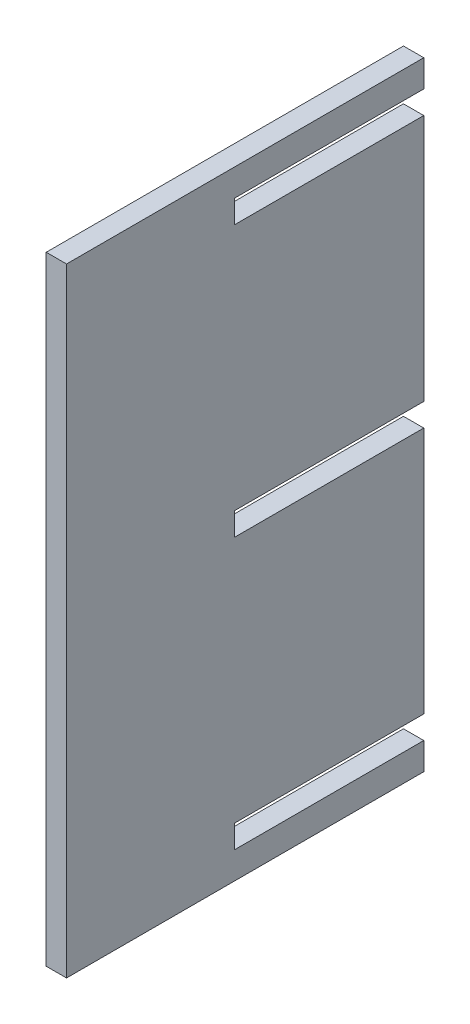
from build123d import *

# Parameters (mm, degrees)
CROQUIS16_W             = 1.5
CROQUIS16_H             = 79.5
SALIENTE_EXTRUIR9_DEPTH = 26.4
CROQUIS20_W             = 14
CROQUIS20_H             = 1.7
CORTAR_EXTRUIR2_DEPTH   = 1.5
CROQUIS21_W             = 26.4
CROQUIS21_H             = 16.9
CORTAR_EXTRUIR3_DEPTH   = 1.5


with BuildPart() as part:
    # Croquis16 → Saliente-Extruir9 (new body)
    with BuildSketch(Plane.XY):
        with Locations((-17.5, 0)):
            Rectangle(CROQUIS16_W, CROQUIS16_H)
    extrude(amount=SALIENTE_EXTRUIR9_DEPTH)

    # Croquis20 → Cortar-Extruir2 (cut)
    with BuildSketch(Plane(origin=(-16.75, 0, 0), x_dir=(0, 0, -1), z_dir=(1, 0, 0))):
        with Locations((-7, -20)):
            Rectangle(CROQUIS20_W, CROQUIS20_H)
        with Locations((-7, 0)):
            Rectangle(CROQUIS20_W, CROQUIS20_H)
        with Locations((-7, 20)):
            Rectangle(CROQUIS20_W, CROQUIS20_H)
    extrude(amount=-CORTAR_EXTRUIR2_DEPTH, mode=Mode.SUBTRACT)

    # Croquis21 → Cortar-Extruir3 (cut)
    with BuildSketch(Plane(origin=(-16.75, 0, 0), x_dir=(0, 0, -1), z_dir=(1, 0, 0))):
        with Locations((-13.2, -31.3)):
            Rectangle(CROQUIS21_W, CROQUIS21_H)
        with Locations((-13.2, 31.3)):
            Rectangle(CROQUIS21_W, CROQUIS21_H)
    extrude(amount=-CORTAR_EXTRUIR3_DEPTH, mode=Mode.SUBTRACT)


solid = part.part
